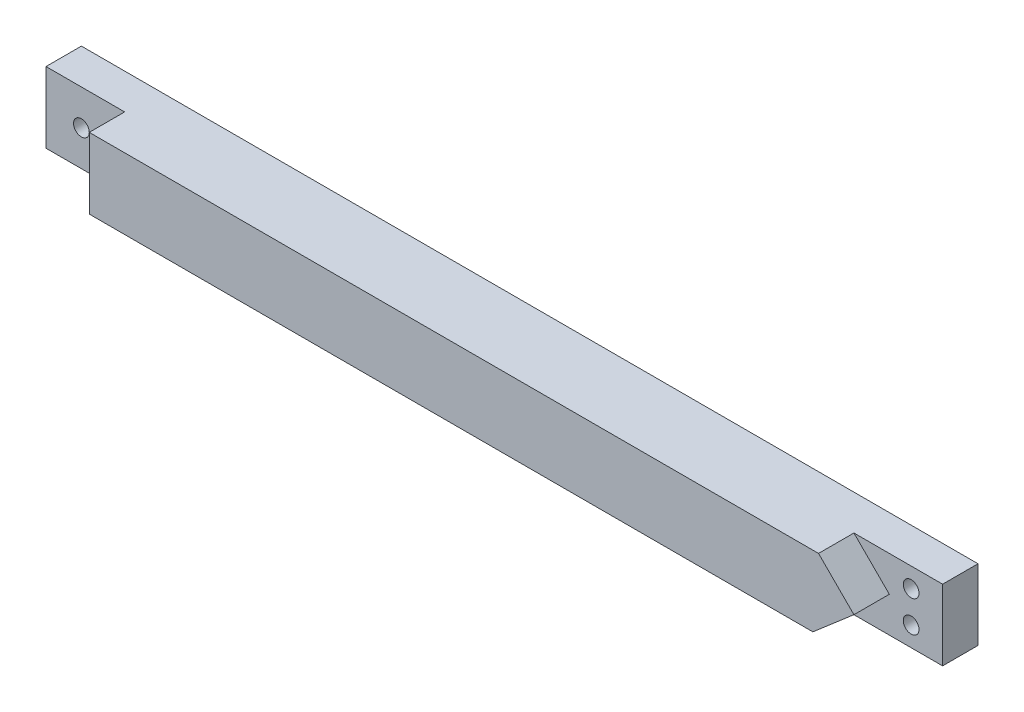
ISO-10303-21;
HEADER;
FILE_DESCRIPTION(('STEP AP214'),'2;1');
FILE_NAME('part.step','',(''),(''),'','','');
FILE_SCHEMA(('AUTOMOTIVE_DESIGN { 1 0 10303 214 1 1 1 1 }'));
ENDSEC;
DATA;
#1=APPLICATION_CONTEXT('core data for automotive mechanical design processes');
#2=APPLICATION_PROTOCOL_DEFINITION('international standard','automotive_design',2000,#1);
#3=PRODUCT_CONTEXT('',#1,'mechanical');
#4=PRODUCT('Part','Part','',(#3));
#5=PRODUCT_RELATED_PRODUCT_CATEGORY('part','',(#4));
#6=PRODUCT_DEFINITION_FORMATION('','',#4);
#7=PRODUCT_DEFINITION_CONTEXT('part definition',#1,'design');
#8=PRODUCT_DEFINITION('design','',#6,#7);
#9=PRODUCT_DEFINITION_SHAPE('','',#8);
#10=(LENGTH_UNIT() NAMED_UNIT(*) SI_UNIT(.MILLI.,.METRE.));
#11=(NAMED_UNIT(*) PLANE_ANGLE_UNIT() SI_UNIT($,.RADIAN.));
#12=(NAMED_UNIT(*) SI_UNIT($,.STERADIAN.) SOLID_ANGLE_UNIT());
#13=UNCERTAINTY_MEASURE_WITH_UNIT(LENGTH_MEASURE(1.E-05),#10,'distance_accuracy_value','');
#14=(GEOMETRIC_REPRESENTATION_CONTEXT(3) GLOBAL_UNCERTAINTY_ASSIGNED_CONTEXT((#13)) GLOBAL_UNIT_ASSIGNED_CONTEXT((#10,
#11,#12)) REPRESENTATION_CONTEXT('',''));
#15=CARTESIAN_POINT('',(0.,0.,0.));
#16=DIRECTION('',(0.,0.,1.));
#17=DIRECTION('',(1.,0.,0.));
#18=AXIS2_PLACEMENT_3D('',#15,#16,#17);
#19=CARTESIAN_POINT('',(114.,0.,9.));
#20=DIRECTION('',(-1.,0.,0.));
#21=DIRECTION('',(0.,0.,1.));
#22=AXIS2_PLACEMENT_3D('',#19,#20,#21);
#23=PLANE('',#22);
#24=DIRECTION('',(0.,1.,0.));
#25=VECTOR('',#24,1.);
#26=CARTESIAN_POINT('',(114.,0.,4.5));
#27=LINE('',#26,#25);
#28=CARTESIAN_POINT('',(114.,0.,4.5));
#29=VERTEX_POINT('',#28);
#30=CARTESIAN_POINT('',(114.,9.,4.5));
#31=VERTEX_POINT('',#30);
#32=EDGE_CURVE('E102',#29,#31,#27,.T.);
#33=ORIENTED_EDGE('',*,*,#32,.F.);
#34=DIRECTION('',(0.,0.,-1.));
#35=VECTOR('',#34,1.);
#36=CARTESIAN_POINT('',(114.,0.,9.));
#37=LINE('',#36,#35);
#38=CARTESIAN_POINT('',(114.,0.,0.));
#39=VERTEX_POINT('',#38);
#40=EDGE_CURVE('E38',#29,#39,#37,.T.);
#41=ORIENTED_EDGE('',*,*,#40,.T.);
#42=DIRECTION('',(0.,1.,0.));
#43=VECTOR('',#42,1.);
#44=CARTESIAN_POINT('',(114.,0.,0.));
#45=LINE('',#44,#43);
#46=CARTESIAN_POINT('',(114.,9.,0.));
#47=VERTEX_POINT('',#46);
#48=EDGE_CURVE('E124',#39,#47,#45,.T.);
#49=ORIENTED_EDGE('',*,*,#48,.T.);
#50=DIRECTION('',(0.,0.,-1.));
#51=VECTOR('',#50,1.);
#52=CARTESIAN_POINT('',(114.,9.,9.));
#53=LINE('',#52,#51);
#54=EDGE_CURVE('E119',#31,#47,#53,.T.);
#55=ORIENTED_EDGE('',*,*,#54,.F.);
#56=EDGE_LOOP('',(#33,#41,#49,#55));
#57=FACE_BOUND('',#56,.T.);
#58=ADVANCED_FACE('F30',(#57),#23,.F.);
#59=CARTESIAN_POINT('',(0.,0.,9.));
#60=DIRECTION('',(1.,0.,0.));
#61=DIRECTION('',(0.,0.,-1.));
#62=AXIS2_PLACEMENT_3D('',#59,#60,#61);
#63=PLANE('',#62);
#64=DIRECTION('',(0.,0.,-1.));
#65=VECTOR('',#64,1.);
#66=CARTESIAN_POINT('',(0.,0.,9.));
#67=LINE('',#66,#65);
#68=CARTESIAN_POINT('',(0.,0.,4.5));
#69=VERTEX_POINT('',#68);
#70=CARTESIAN_POINT('',(0.,0.,0.));
#71=VERTEX_POINT('',#70);
#72=EDGE_CURVE('E11',#69,#71,#67,.T.);
#73=ORIENTED_EDGE('',*,*,#72,.F.);
#74=DIRECTION('',(0.,-1.,0.));
#75=VECTOR('',#74,1.);
#76=CARTESIAN_POINT('',(0.,0.,4.5));
#77=LINE('',#76,#75);
#78=CARTESIAN_POINT('',(0.,9.,4.5));
#79=VERTEX_POINT('',#78);
#80=EDGE_CURVE('E151',#79,#69,#77,.T.);
#81=ORIENTED_EDGE('',*,*,#80,.F.);
#82=DIRECTION('',(0.,0.,-1.));
#83=VECTOR('',#82,1.);
#84=CARTESIAN_POINT('',(0.,9.,9.));
#85=LINE('',#84,#83);
#86=CARTESIAN_POINT('',(0.,9.,0.));
#87=VERTEX_POINT('',#86);
#88=EDGE_CURVE('E126',#79,#87,#85,.T.);
#89=ORIENTED_EDGE('',*,*,#88,.T.);
#90=DIRECTION('',(0.,-1.,0.));
#91=VECTOR('',#90,1.);
#92=CARTESIAN_POINT('',(0.,0.,0.));
#93=LINE('',#92,#91);
#94=EDGE_CURVE('E138',#87,#71,#93,.T.);
#95=ORIENTED_EDGE('',*,*,#94,.T.);
#96=EDGE_LOOP('',(#73,#81,#89,#95));
#97=FACE_BOUND('',#96,.T.);
#98=ADVANCED_FACE('F32',(#97),#63,.F.);
#99=CARTESIAN_POINT('',(0.,0.,9.));
#100=DIRECTION('',(0.,1.,0.));
#101=DIRECTION('',(0.,0.,1.));
#102=AXIS2_PLACEMENT_3D('',#99,#100,#101);
#103=PLANE('',#102);
#104=DIRECTION('',(1.,0.,0.));
#105=VECTOR('',#104,1.);
#106=CARTESIAN_POINT('',(102.,0.,4.5));
#107=LINE('',#106,#105);
#108=CARTESIAN_POINT('',(102.,0.,4.5));
#109=VERTEX_POINT('',#108);
#110=EDGE_CURVE('E109',#109,#29,#107,.T.);
#111=ORIENTED_EDGE('',*,*,#110,.F.);
#112=DIRECTION('',(0.,0.,1.));
#113=VECTOR('',#112,1.);
#114=CARTESIAN_POINT('',(102.,0.,4.5));
#115=LINE('',#114,#113);
#116=CARTESIAN_POINT('',(102.,0.,9.));
#117=VERTEX_POINT('',#116);
#118=EDGE_CURVE('E164',#109,#117,#115,.T.);
#119=ORIENTED_EDGE('',*,*,#118,.T.);
#120=DIRECTION('',(1.,0.,0.));
#121=VECTOR('',#120,1.);
#122=CARTESIAN_POINT('',(0.,0.,9.));
#123=LINE('',#122,#121);
#124=CARTESIAN_POINT('',(10.,0.,9.));
#125=VERTEX_POINT('',#124);
#126=EDGE_CURVE('E133',#125,#117,#123,.T.);
#127=ORIENTED_EDGE('',*,*,#126,.F.);
#128=DIRECTION('',(0.,0.,1.));
#129=VECTOR('',#128,1.);
#130=CARTESIAN_POINT('',(10.,0.,4.5));
#131=LINE('',#130,#129);
#132=CARTESIAN_POINT('',(10.,0.,4.5));
#133=VERTEX_POINT('',#132);
#134=EDGE_CURVE('E53',#133,#125,#131,.T.);
#135=ORIENTED_EDGE('',*,*,#134,.F.);
#136=DIRECTION('',(1.,0.,0.));
#137=VECTOR('',#136,1.);
#138=CARTESIAN_POINT('',(0.,0.,4.5));
#139=LINE('',#138,#137);
#140=EDGE_CURVE('E157',#69,#133,#139,.T.);
#141=ORIENTED_EDGE('',*,*,#140,.F.);
#142=ORIENTED_EDGE('',*,*,#72,.T.);
#143=DIRECTION('',(1.,0.,0.));
#144=VECTOR('',#143,1.);
#145=CARTESIAN_POINT('',(0.,0.,0.));
#146=LINE('',#145,#144);
#147=EDGE_CURVE('E135',#71,#39,#146,.T.);
#148=ORIENTED_EDGE('',*,*,#147,.T.);
#149=ORIENTED_EDGE('',*,*,#40,.F.);
#150=EDGE_LOOP('',(#111,#119,#127,#135,#141,#142,#148,#149));
#151=FACE_BOUND('',#150,.T.);
#152=ADVANCED_FACE('F219',(#151),#103,.F.);
#153=CARTESIAN_POINT('',(0.,9.,9.));
#154=DIRECTION('',(0.,-1.,0.));
#155=DIRECTION('',(0.,0.,-1.));
#156=AXIS2_PLACEMENT_3D('',#153,#154,#155);
#157=PLANE('',#156);
#158=DIRECTION('',(-1.,0.,0.));
#159=VECTOR('',#158,1.);
#160=CARTESIAN_POINT('',(0.,9.,9.));
#161=LINE('',#160,#159);
#162=CARTESIAN_POINT('',(102.724684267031,9.,9.));
#163=VERTEX_POINT('',#162);
#164=CARTESIAN_POINT('',(10.,9.,9.));
#165=VERTEX_POINT('',#164);
#166=EDGE_CURVE('E128',#163,#165,#161,.T.);
#167=ORIENTED_EDGE('',*,*,#166,.F.);
#168=DIRECTION('',(0.,0.,1.));
#169=VECTOR('',#168,1.);
#170=CARTESIAN_POINT('',(102.724684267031,9.,4.5));
#171=LINE('',#170,#169);
#172=CARTESIAN_POINT('',(102.724684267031,9.,4.5));
#173=VERTEX_POINT('',#172);
#174=EDGE_CURVE('E45',#173,#163,#171,.T.);
#175=ORIENTED_EDGE('',*,*,#174,.F.);
#176=DIRECTION('',(-1.,0.,0.));
#177=VECTOR('',#176,1.);
#178=CARTESIAN_POINT('',(114.,9.,4.5));
#179=LINE('',#178,#177);
#180=EDGE_CURVE('E106',#31,#173,#179,.T.);
#181=ORIENTED_EDGE('',*,*,#180,.F.);
#182=ORIENTED_EDGE('',*,*,#54,.T.);
#183=DIRECTION('',(-1.,0.,0.));
#184=VECTOR('',#183,1.);
#185=CARTESIAN_POINT('',(0.,9.,0.));
#186=LINE('',#185,#184);
#187=EDGE_CURVE('E131',#47,#87,#186,.T.);
#188=ORIENTED_EDGE('',*,*,#187,.T.);
#189=ORIENTED_EDGE('',*,*,#88,.F.);
#190=DIRECTION('',(-1.,0.,0.));
#191=VECTOR('',#190,1.);
#192=CARTESIAN_POINT('',(0.,9.,4.5));
#193=LINE('',#192,#191);
#194=CARTESIAN_POINT('',(10.,9.,4.5));
#195=VERTEX_POINT('',#194);
#196=EDGE_CURVE('E146',#195,#79,#193,.T.);
#197=ORIENTED_EDGE('',*,*,#196,.F.);
#198=DIRECTION('',(0.,0.,1.));
#199=VECTOR('',#198,1.);
#200=CARTESIAN_POINT('',(10.,9.,4.5));
#201=LINE('',#200,#199);
#202=EDGE_CURVE('E141',#195,#165,#201,.T.);
#203=ORIENTED_EDGE('',*,*,#202,.T.);
#204=EDGE_LOOP('',(#167,#175,#181,#182,#188,#189,#197,#203));
#205=FACE_BOUND('',#204,.T.);
#206=ADVANCED_FACE('F117',(#205),#157,.F.);
#207=CARTESIAN_POINT('',(0.,9.,9.));
#208=DIRECTION('',(0.,0.,-1.));
#209=DIRECTION('',(-1.,0.,0.));
#210=AXIS2_PLACEMENT_3D('',#207,#208,#209);
#211=PLANE('',#210);
#212=ORIENTED_EDGE('',*,*,#126,.T.);
#213=DIRECTION('',(-0.757699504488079,-0.652603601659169,0.));
#214=VECTOR('',#213,1.);
#215=CARTESIAN_POINT('',(107.224684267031,4.5,9.));
#216=LINE('',#215,#214);
#217=CARTESIAN_POINT('',(107.224684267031,4.5,9.));
#218=VERTEX_POINT('',#217);
#219=EDGE_CURVE('E113',#218,#117,#216,.T.);
#220=ORIENTED_EDGE('',*,*,#219,.F.);
#221=DIRECTION('',(0.707106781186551,-0.707106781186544,0.));
#222=VECTOR('',#221,1.);
#223=CARTESIAN_POINT('',(102.724684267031,9.,9.));
#224=LINE('',#223,#222);
#225=EDGE_CURVE('E173',#163,#218,#224,.T.);
#226=ORIENTED_EDGE('',*,*,#225,.F.);
#227=ORIENTED_EDGE('',*,*,#166,.T.);
#228=DIRECTION('',(0.,1.,0.));
#229=VECTOR('',#228,1.);
#230=CARTESIAN_POINT('',(10.,0.,9.));
#231=LINE('',#230,#229);
#232=EDGE_CURVE('E149',#125,#165,#231,.T.);
#233=ORIENTED_EDGE('',*,*,#232,.F.);
#234=EDGE_LOOP('',(#212,#220,#226,#227,#233));
#235=FACE_BOUND('',#234,.T.);
#236=ADVANCED_FACE('F228',(#235),#211,.F.);
#237=CARTESIAN_POINT('',(0.,9.,0.));
#238=DIRECTION('',(0.,0.,-1.));
#239=DIRECTION('',(-1.,0.,0.));
#240=AXIS2_PLACEMENT_3D('',#237,#238,#239);
#241=PLANE('',#240);
#242=CARTESIAN_POINT('',(110.,2.5,0.));
#243=DIRECTION('',(0.,0.,1.));
#244=DIRECTION('',(1.,0.,0.));
#245=AXIS2_PLACEMENT_3D('',#242,#243,#244);
#246=CIRCLE('',#245,0.999999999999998);
#247=CARTESIAN_POINT('',(111.,2.5,0.));
#248=VERTEX_POINT('',#247);
#249=EDGE_CURVE('E183',#248,#248,#246,.T.);
#250=ORIENTED_EDGE('',*,*,#249,.T.);
#251=EDGE_LOOP('',(#250));
#252=FACE_BOUND('',#251,.T.);
#253=CARTESIAN_POINT('',(110.,6.5,0.));
#254=DIRECTION('',(0.,0.,1.));
#255=DIRECTION('',(1.,0.,0.));
#256=AXIS2_PLACEMENT_3D('',#253,#254,#255);
#257=CIRCLE('',#256,0.999999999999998);
#258=CARTESIAN_POINT('',(111.,6.5,0.));
#259=VERTEX_POINT('',#258);
#260=EDGE_CURVE('E175',#259,#259,#257,.T.);
#261=ORIENTED_EDGE('',*,*,#260,.T.);
#262=EDGE_LOOP('',(#261));
#263=FACE_BOUND('',#262,.T.);
#264=CARTESIAN_POINT('',(4.5,4.5,0.));
#265=DIRECTION('',(0.,0.,1.));
#266=DIRECTION('',(1.,0.,0.));
#267=AXIS2_PLACEMENT_3D('',#264,#265,#266);
#268=CIRCLE('',#267,1.);
#269=CARTESIAN_POINT('',(5.5,4.5,0.));
#270=VERTEX_POINT('',#269);
#271=EDGE_CURVE('E152',#270,#270,#268,.T.);
#272=ORIENTED_EDGE('',*,*,#271,.T.);
#273=EDGE_LOOP('',(#272));
#274=FACE_BOUND('',#273,.T.);
#275=ORIENTED_EDGE('',*,*,#94,.F.);
#276=ORIENTED_EDGE('',*,*,#187,.F.);
#277=ORIENTED_EDGE('',*,*,#48,.F.);
#278=ORIENTED_EDGE('',*,*,#147,.F.);
#279=EDGE_LOOP('',(#275,#276,#277,#278));
#280=FACE_BOUND('',#279,.T.);
#281=ADVANCED_FACE('F192',(#252,#263,#274,#280),#241,.T.);
#282=CARTESIAN_POINT('',(10.,0.,4.5));
#283=DIRECTION('',(1.,0.,0.));
#284=DIRECTION('',(0.,0.,-1.));
#285=AXIS2_PLACEMENT_3D('',#282,#283,#284);
#286=PLANE('',#285);
#287=ORIENTED_EDGE('',*,*,#232,.T.);
#288=ORIENTED_EDGE('',*,*,#202,.F.);
#289=DIRECTION('',(0.,1.,0.));
#290=VECTOR('',#289,1.);
#291=CARTESIAN_POINT('',(10.,0.,4.5));
#292=LINE('',#291,#290);
#293=EDGE_CURVE('E154',#133,#195,#292,.T.);
#294=ORIENTED_EDGE('',*,*,#293,.F.);
#295=ORIENTED_EDGE('',*,*,#134,.T.);
#296=EDGE_LOOP('',(#287,#288,#294,#295));
#297=FACE_BOUND('',#296,.T.);
#298=ADVANCED_FACE('F242',(#297),#286,.F.);
#299=CARTESIAN_POINT('',(0.,9.,4.5));
#300=DIRECTION('',(0.,0.,-1.));
#301=DIRECTION('',(-1.,0.,0.));
#302=AXIS2_PLACEMENT_3D('',#299,#300,#301);
#303=PLANE('',#302);
#304=CARTESIAN_POINT('',(4.5,4.5,4.5));
#305=DIRECTION('',(0.,0.,1.));
#306=DIRECTION('',(1.,0.,0.));
#307=AXIS2_PLACEMENT_3D('',#304,#305,#306);
#308=CIRCLE('',#307,1.);
#309=CARTESIAN_POINT('',(5.5,4.5,4.5));
#310=VERTEX_POINT('',#309);
#311=EDGE_CURVE('E161',#310,#310,#308,.T.);
#312=ORIENTED_EDGE('',*,*,#311,.F.);
#313=EDGE_LOOP('',(#312));
#314=FACE_BOUND('',#313,.T.);
#315=ORIENTED_EDGE('',*,*,#80,.T.);
#316=ORIENTED_EDGE('',*,*,#140,.T.);
#317=ORIENTED_EDGE('',*,*,#293,.T.);
#318=ORIENTED_EDGE('',*,*,#196,.T.);
#319=EDGE_LOOP('',(#315,#316,#317,#318));
#320=FACE_BOUND('',#319,.T.);
#321=ADVANCED_FACE('F239',(#314,#320),#303,.F.);
#322=CARTESIAN_POINT('',(4.5,4.5,0.));
#323=DIRECTION('',(0.,0.,1.));
#324=DIRECTION('',(1.,0.,0.));
#325=AXIS2_PLACEMENT_3D('',#322,#323,#324);
#326=CYLINDRICAL_SURFACE('',#325,1.);
#327=ORIENTED_EDGE('',*,*,#271,.F.);
#328=EDGE_LOOP('',(#327));
#329=FACE_BOUND('',#328,.T.);
#330=ORIENTED_EDGE('',*,*,#311,.T.);
#331=EDGE_LOOP('',(#330));
#332=FACE_BOUND('',#331,.T.);
#333=ADVANCED_FACE('F249',(#329,#332),#326,.F.);
#334=CARTESIAN_POINT('',(107.224684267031,4.5,4.5));
#335=DIRECTION('',(-0.652603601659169,0.757699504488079,0.));
#336=DIRECTION('',(-0.757699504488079,-0.652603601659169,0.));
#337=AXIS2_PLACEMENT_3D('',#334,#335,#336);
#338=PLANE('',#337);
#339=ORIENTED_EDGE('',*,*,#219,.T.);
#340=ORIENTED_EDGE('',*,*,#118,.F.);
#341=DIRECTION('',(-0.757699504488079,-0.652603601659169,0.));
#342=VECTOR('',#341,1.);
#343=CARTESIAN_POINT('',(107.224684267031,4.5,4.5));
#344=LINE('',#343,#342);
#345=CARTESIAN_POINT('',(107.224684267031,4.5,4.5));
#346=VERTEX_POINT('',#345);
#347=EDGE_CURVE('E177',#346,#109,#344,.T.);
#348=ORIENTED_EDGE('',*,*,#347,.F.);
#349=DIRECTION('',(0.,0.,1.));
#350=VECTOR('',#349,1.);
#351=CARTESIAN_POINT('',(107.224684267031,4.5,4.5));
#352=LINE('',#351,#350);
#353=EDGE_CURVE('E168',#346,#218,#352,.T.);
#354=ORIENTED_EDGE('',*,*,#353,.T.);
#355=EDGE_LOOP('',(#339,#340,#348,#354));
#356=FACE_BOUND('',#355,.T.);
#357=ADVANCED_FACE('F291',(#356),#338,.F.);
#358=CARTESIAN_POINT('',(102.724684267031,9.,4.5));
#359=DIRECTION('',(-0.707106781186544,-0.707106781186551,0.));
#360=DIRECTION('',(0.707106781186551,-0.707106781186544,0.));
#361=AXIS2_PLACEMENT_3D('',#358,#359,#360);
#362=PLANE('',#361);
#363=ORIENTED_EDGE('',*,*,#225,.T.);
#364=ORIENTED_EDGE('',*,*,#353,.F.);
#365=DIRECTION('',(0.707106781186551,-0.707106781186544,0.));
#366=VECTOR('',#365,1.);
#367=CARTESIAN_POINT('',(102.724684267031,9.,4.5));
#368=LINE('',#367,#366);
#369=EDGE_CURVE('E121',#173,#346,#368,.T.);
#370=ORIENTED_EDGE('',*,*,#369,.F.);
#371=ORIENTED_EDGE('',*,*,#174,.T.);
#372=EDGE_LOOP('',(#363,#364,#370,#371));
#373=FACE_BOUND('',#372,.T.);
#374=ADVANCED_FACE('F204',(#373),#362,.F.);
#375=CARTESIAN_POINT('',(114.,9.,4.5));
#376=DIRECTION('',(0.,0.,1.));
#377=DIRECTION('',(1.,0.,0.));
#378=AXIS2_PLACEMENT_3D('',#375,#376,#377);
#379=PLANE('',#378);
#380=CARTESIAN_POINT('',(110.,2.5,4.5));
#381=DIRECTION('',(0.,0.,1.));
#382=DIRECTION('',(1.,0.,0.));
#383=AXIS2_PLACEMENT_3D('',#380,#381,#382);
#384=CIRCLE('',#383,0.999999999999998);
#385=CARTESIAN_POINT('',(111.,2.5,4.5));
#386=VERTEX_POINT('',#385);
#387=EDGE_CURVE('E186',#386,#386,#384,.T.);
#388=ORIENTED_EDGE('',*,*,#387,.F.);
#389=EDGE_LOOP('',(#388));
#390=FACE_BOUND('',#389,.T.);
#391=CARTESIAN_POINT('',(110.,6.5,4.5));
#392=DIRECTION('',(0.,0.,1.));
#393=DIRECTION('',(1.,0.,0.));
#394=AXIS2_PLACEMENT_3D('',#391,#392,#393);
#395=CIRCLE('',#394,0.999999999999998);
#396=CARTESIAN_POINT('',(111.,6.5,4.5));
#397=VERTEX_POINT('',#396);
#398=EDGE_CURVE('E180',#397,#397,#395,.T.);
#399=ORIENTED_EDGE('',*,*,#398,.F.);
#400=EDGE_LOOP('',(#399));
#401=FACE_BOUND('',#400,.T.);
#402=ORIENTED_EDGE('',*,*,#32,.T.);
#403=ORIENTED_EDGE('',*,*,#180,.T.);
#404=ORIENTED_EDGE('',*,*,#369,.T.);
#405=ORIENTED_EDGE('',*,*,#347,.T.);
#406=ORIENTED_EDGE('',*,*,#110,.T.);
#407=EDGE_LOOP('',(#402,#403,#404,#405,#406));
#408=FACE_BOUND('',#407,.T.);
#409=ADVANCED_FACE('F104',(#390,#401,#408),#379,.T.);
#410=CARTESIAN_POINT('',(110.,6.5,0.));
#411=DIRECTION('',(0.,0.,1.));
#412=DIRECTION('',(1.,0.,0.));
#413=AXIS2_PLACEMENT_3D('',#410,#411,#412);
#414=CYLINDRICAL_SURFACE('',#413,0.999999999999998);
#415=ORIENTED_EDGE('',*,*,#260,.F.);
#416=EDGE_LOOP('',(#415));
#417=FACE_BOUND('',#416,.T.);
#418=ORIENTED_EDGE('',*,*,#398,.T.);
#419=EDGE_LOOP('',(#418));
#420=FACE_BOUND('',#419,.T.);
#421=ADVANCED_FACE('F198',(#417,#420),#414,.F.);
#422=CARTESIAN_POINT('',(110.,2.5,0.));
#423=DIRECTION('',(0.,0.,1.));
#424=DIRECTION('',(1.,0.,0.));
#425=AXIS2_PLACEMENT_3D('',#422,#423,#424);
#426=CYLINDRICAL_SURFACE('',#425,0.999999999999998);
#427=ORIENTED_EDGE('',*,*,#249,.F.);
#428=EDGE_LOOP('',(#427));
#429=FACE_BOUND('',#428,.T.);
#430=ORIENTED_EDGE('',*,*,#387,.T.);
#431=EDGE_LOOP('',(#430));
#432=FACE_BOUND('',#431,.T.);
#433=ADVANCED_FACE('F195',(#429,#432),#426,.F.);
#434=CLOSED_SHELL('',(#58,#98,#152,#206,#236,#281,#298,#321,#333,#357,#374,#409,#421,#433));
#435=MANIFOLD_SOLID_BREP('B2',#434);
#436=ADVANCED_BREP_SHAPE_REPRESENTATION('',(#18,#435),#14);
#437=SHAPE_DEFINITION_REPRESENTATION(#9,#436);
ENDSEC;
END-ISO-10303-21;
